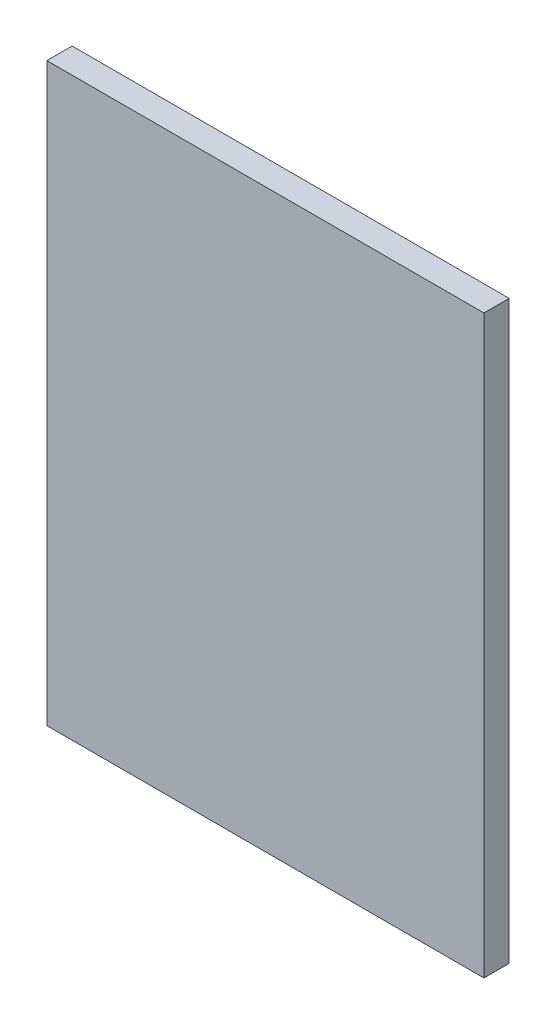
ISO-10303-21;
HEADER;
FILE_DESCRIPTION(('STEP AP214'),'2;1');
FILE_NAME('part.step','',(''),(''),'','','');
FILE_SCHEMA(('AUTOMOTIVE_DESIGN { 1 0 10303 214 1 1 1 1 }'));
ENDSEC;
DATA;
#1=APPLICATION_CONTEXT('core data for automotive mechanical design processes');
#2=APPLICATION_PROTOCOL_DEFINITION('international standard','automotive_design',2000,#1);
#3=PRODUCT_CONTEXT('',#1,'mechanical');
#4=PRODUCT('Part','Part','',(#3));
#5=PRODUCT_RELATED_PRODUCT_CATEGORY('part','',(#4));
#6=PRODUCT_DEFINITION_FORMATION('','',#4);
#7=PRODUCT_DEFINITION_CONTEXT('part definition',#1,'design');
#8=PRODUCT_DEFINITION('design','',#6,#7);
#9=PRODUCT_DEFINITION_SHAPE('','',#8);
#10=(LENGTH_UNIT() NAMED_UNIT(*) SI_UNIT(.MILLI.,.METRE.));
#11=(NAMED_UNIT(*) PLANE_ANGLE_UNIT() SI_UNIT($,.RADIAN.));
#12=(NAMED_UNIT(*) SI_UNIT($,.STERADIAN.) SOLID_ANGLE_UNIT());
#13=UNCERTAINTY_MEASURE_WITH_UNIT(LENGTH_MEASURE(1.E-05),#10,'distance_accuracy_value','');
#14=(GEOMETRIC_REPRESENTATION_CONTEXT(3) GLOBAL_UNCERTAINTY_ASSIGNED_CONTEXT((#13)) GLOBAL_UNIT_ASSIGNED_CONTEXT((#10,
#11,#12)) REPRESENTATION_CONTEXT('',''));
#15=CARTESIAN_POINT('',(0.,0.,0.));
#16=DIRECTION('',(0.,0.,1.));
#17=DIRECTION('',(1.,0.,0.));
#18=AXIS2_PLACEMENT_3D('',#15,#16,#17);
#19=CARTESIAN_POINT('',(0.,0.,16.));
#20=DIRECTION('',(1.,0.,0.));
#21=DIRECTION('',(0.,1.,0.));
#22=AXIS2_PLACEMENT_3D('',#19,#20,#21);
#23=PLANE('',#22);
#24=DIRECTION('',(0.,-1.,0.));
#25=VECTOR('',#24,1.);
#26=CARTESIAN_POINT('',(0.,0.,0.));
#27=LINE('',#26,#25);
#28=CARTESIAN_POINT('',(0.,0.,0.));
#29=VERTEX_POINT('',#28);
#30=CARTESIAN_POINT('',(0.,-365.,0.));
#31=VERTEX_POINT('',#30);
#32=EDGE_CURVE('E94',#29,#31,#27,.T.);
#33=ORIENTED_EDGE('',*,*,#32,.T.);
#34=DIRECTION('',(0.,0.,-1.));
#35=VECTOR('',#34,1.);
#36=CARTESIAN_POINT('',(0.,-365.,16.));
#37=LINE('',#36,#35);
#38=CARTESIAN_POINT('',(0.,-365.,16.));
#39=VERTEX_POINT('',#38);
#40=EDGE_CURVE('E11',#39,#31,#37,.T.);
#41=ORIENTED_EDGE('',*,*,#40,.F.);
#42=DIRECTION('',(0.,-1.,0.));
#43=VECTOR('',#42,1.);
#44=CARTESIAN_POINT('',(0.,0.,16.));
#45=LINE('',#44,#43);
#46=CARTESIAN_POINT('',(0.,0.,16.));
#47=VERTEX_POINT('',#46);
#48=EDGE_CURVE('E82',#47,#39,#45,.T.);
#49=ORIENTED_EDGE('',*,*,#48,.F.);
#50=DIRECTION('',(0.,0.,-1.));
#51=VECTOR('',#50,1.);
#52=CARTESIAN_POINT('',(0.,0.,16.));
#53=LINE('',#52,#51);
#54=EDGE_CURVE('E90',#47,#29,#53,.T.);
#55=ORIENTED_EDGE('',*,*,#54,.T.);
#56=EDGE_LOOP('',(#33,#41,#49,#55));
#57=FACE_BOUND('',#56,.T.);
#58=ADVANCED_FACE('F31',(#57),#23,.F.);
#59=CARTESIAN_POINT('',(0.,-365.,16.));
#60=DIRECTION('',(0.,1.,0.));
#61=DIRECTION('',(0.,0.,1.));
#62=AXIS2_PLACEMENT_3D('',#59,#60,#61);
#63=PLANE('',#62);
#64=DIRECTION('',(1.,0.,0.));
#65=VECTOR('',#64,1.);
#66=CARTESIAN_POINT('',(0.,-365.,0.));
#67=LINE('',#66,#65);
#68=CARTESIAN_POINT('',(277.,-365.,0.));
#69=VERTEX_POINT('',#68);
#70=EDGE_CURVE('E86',#31,#69,#67,.T.);
#71=ORIENTED_EDGE('',*,*,#70,.T.);
#72=DIRECTION('',(0.,0.,-1.));
#73=VECTOR('',#72,1.);
#74=CARTESIAN_POINT('',(277.,-365.,16.));
#75=LINE('',#74,#73);
#76=CARTESIAN_POINT('',(277.,-365.,16.));
#77=VERTEX_POINT('',#76);
#78=EDGE_CURVE('E39',#77,#69,#75,.T.);
#79=ORIENTED_EDGE('',*,*,#78,.F.);
#80=DIRECTION('',(1.,0.,0.));
#81=VECTOR('',#80,1.);
#82=CARTESIAN_POINT('',(0.,-365.,16.));
#83=LINE('',#82,#81);
#84=EDGE_CURVE('E77',#39,#77,#83,.T.);
#85=ORIENTED_EDGE('',*,*,#84,.F.);
#86=ORIENTED_EDGE('',*,*,#40,.T.);
#87=EDGE_LOOP('',(#71,#79,#85,#86));
#88=FACE_BOUND('',#87,.T.);
#89=ADVANCED_FACE('F85',(#88),#63,.F.);
#90=CARTESIAN_POINT('',(277.,0.,16.));
#91=DIRECTION('',(-1.,0.,0.));
#92=DIRECTION('',(0.,-1.,0.));
#93=AXIS2_PLACEMENT_3D('',#90,#91,#92);
#94=PLANE('',#93);
#95=DIRECTION('',(0.,1.,0.));
#96=VECTOR('',#95,1.);
#97=CARTESIAN_POINT('',(277.,0.,0.));
#98=LINE('',#97,#96);
#99=CARTESIAN_POINT('',(277.,0.,0.));
#100=VERTEX_POINT('',#99);
#101=EDGE_CURVE('E64',#69,#100,#98,.T.);
#102=ORIENTED_EDGE('',*,*,#101,.T.);
#103=DIRECTION('',(0.,0.,-1.));
#104=VECTOR('',#103,1.);
#105=CARTESIAN_POINT('',(277.,0.,16.));
#106=LINE('',#105,#104);
#107=CARTESIAN_POINT('',(277.,0.,16.));
#108=VERTEX_POINT('',#107);
#109=EDGE_CURVE('E87',#108,#100,#106,.T.);
#110=ORIENTED_EDGE('',*,*,#109,.F.);
#111=DIRECTION('',(0.,1.,0.));
#112=VECTOR('',#111,1.);
#113=CARTESIAN_POINT('',(277.,0.,16.));
#114=LINE('',#113,#112);
#115=EDGE_CURVE('E80',#77,#108,#114,.T.);
#116=ORIENTED_EDGE('',*,*,#115,.F.);
#117=ORIENTED_EDGE('',*,*,#78,.T.);
#118=EDGE_LOOP('',(#102,#110,#116,#117));
#119=FACE_BOUND('',#118,.T.);
#120=ADVANCED_FACE('F88',(#119),#94,.F.);
#121=CARTESIAN_POINT('',(0.,0.,16.));
#122=DIRECTION('',(0.,-1.,0.));
#123=DIRECTION('',(0.,0.,-1.));
#124=AXIS2_PLACEMENT_3D('',#121,#122,#123);
#125=PLANE('',#124);
#126=DIRECTION('',(-1.,0.,0.));
#127=VECTOR('',#126,1.);
#128=CARTESIAN_POINT('',(0.,0.,0.));
#129=LINE('',#128,#127);
#130=EDGE_CURVE('E70',#100,#29,#129,.T.);
#131=ORIENTED_EDGE('',*,*,#130,.T.);
#132=ORIENTED_EDGE('',*,*,#54,.F.);
#133=DIRECTION('',(-1.,0.,0.));
#134=VECTOR('',#133,1.);
#135=CARTESIAN_POINT('',(0.,0.,16.));
#136=LINE('',#135,#134);
#137=EDGE_CURVE('E47',#108,#47,#136,.T.);
#138=ORIENTED_EDGE('',*,*,#137,.F.);
#139=ORIENTED_EDGE('',*,*,#109,.T.);
#140=EDGE_LOOP('',(#131,#132,#138,#139));
#141=FACE_BOUND('',#140,.T.);
#142=ADVANCED_FACE('F101',(#141),#125,.F.);
#143=CARTESIAN_POINT('',(0.,-365.,16.));
#144=DIRECTION('',(0.,0.,1.));
#145=DIRECTION('',(1.,0.,0.));
#146=AXIS2_PLACEMENT_3D('',#143,#144,#145);
#147=PLANE('',#146);
#148=ORIENTED_EDGE('',*,*,#48,.T.);
#149=ORIENTED_EDGE('',*,*,#84,.T.);
#150=ORIENTED_EDGE('',*,*,#115,.T.);
#151=ORIENTED_EDGE('',*,*,#137,.T.);
#152=EDGE_LOOP('',(#148,#149,#150,#151));
#153=FACE_BOUND('',#152,.T.);
#154=ADVANCED_FACE('F78',(#153),#147,.T.);
#155=CARTESIAN_POINT('',(0.,-365.,0.));
#156=DIRECTION('',(0.,0.,1.));
#157=DIRECTION('',(1.,0.,0.));
#158=AXIS2_PLACEMENT_3D('',#155,#156,#157);
#159=PLANE('',#158);
#160=ORIENTED_EDGE('',*,*,#32,.F.);
#161=ORIENTED_EDGE('',*,*,#130,.F.);
#162=ORIENTED_EDGE('',*,*,#101,.F.);
#163=ORIENTED_EDGE('',*,*,#70,.F.);
#164=EDGE_LOOP('',(#160,#161,#162,#163));
#165=FACE_BOUND('',#164,.T.);
#166=ADVANCED_FACE('F104',(#165),#159,.F.);
#167=CLOSED_SHELL('',(#58,#89,#120,#142,#154,#166));
#168=MANIFOLD_SOLID_BREP('B2',#167);
#169=ADVANCED_BREP_SHAPE_REPRESENTATION('',(#18,#168),#14);
#170=SHAPE_DEFINITION_REPRESENTATION(#9,#169);
ENDSEC;
END-ISO-10303-21;
